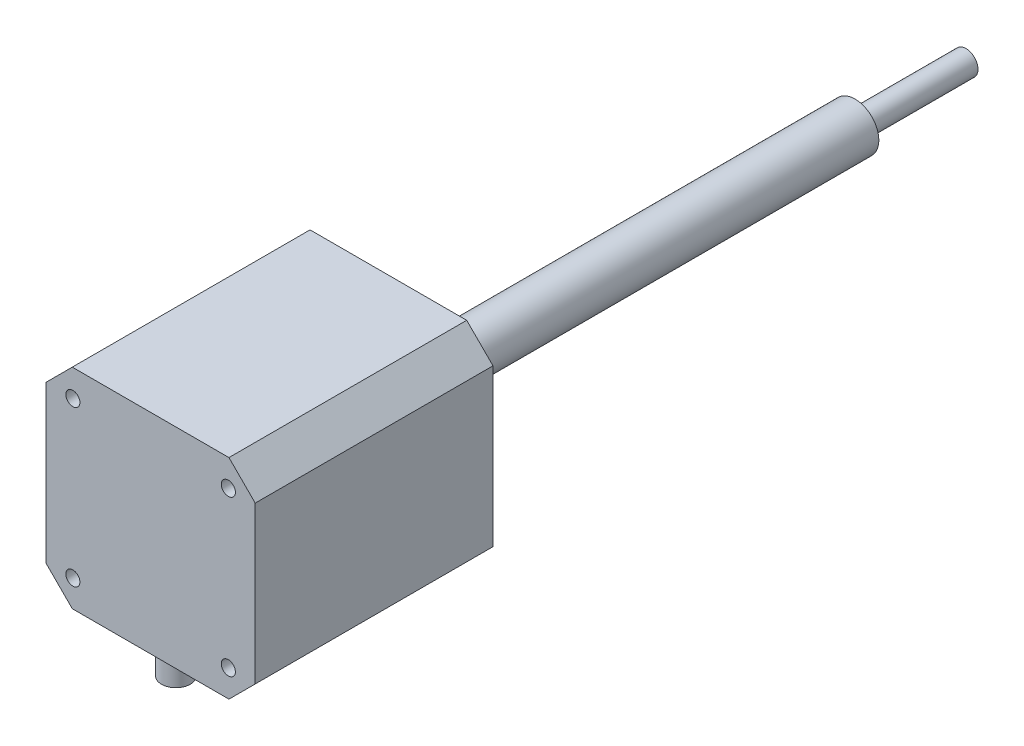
from build123d import *

# Parameters (mm, degrees)
SKETCH1_W           = 41.91
SKETCH1_H           = 41.91
BASE_EXTRUDE_DEPTH  = 47.625
SKETCH2_R           = 1.4097
CUT_EXTRUDE2_DEPTH  = 57.092465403
SKETCH4_R           = 2.8956
BOSS_EXTRUDE2_DEPTH = 6.35


with BuildPart() as part:
    # Sketch1 → Base-Extrude (new body)
    with BuildSketch(Plane.XY):
        Rectangle(SKETCH1_W, SKETCH1_H)
    extrude(amount=BASE_EXTRUDE_DEPTH)

    # Sketch2 → Cut-Extrude2 (cut, through all)
    with BuildSketch(Plane.XY.offset(47.625)):
        with Locations(Location((15.5702, 15.5702, 0), (0, 0, 180))):
            Circle(SKETCH2_R)
        with Locations((15.5702, -15.5702)):
            Circle(SKETCH2_R)
        with Locations((-15.5702, 15.5702)):
            Circle(SKETCH2_R)
        with Locations(Location((-15.5702, -15.5702, 0), (0, 0, 180))):
            Circle(SKETCH2_R)
        Polygon((20.740974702, -15.904485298), (15.940915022, -20.704544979), (13.563579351, -23.08188065), (24.093200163, -23.08188065), (24.093200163, -12.552259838), align=None)
        Polygon((-20.704544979, 15.940915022), (-23.08188065, 13.563579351), (-23.08188065, 24.093200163), (-12.552259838, 24.093200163), (-15.904485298, 20.740974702), align=None)
        Polygon((-23.08188065, -13.563579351), (-23.08188065, -24.093200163), (-12.552259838, -24.093200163), (-15.904485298, -20.740974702), (-20.704544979, -15.940915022), align=None)
        Polygon((13.563579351, 23.08188065), (24.093200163, 23.08188065), (24.093200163, 12.552259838), (20.740974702, 15.904485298), (15.940915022, 20.704544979), align=None)
    extrude(amount=-CUT_EXTRUDE2_DEPTH, mode=Mode.SUBTRACT)

    # Sketch4 → Boss-Extrude2 (add)
    with BuildSketch(Plane(origin=(0, -20.955, 0), x_dir=(-1, 0, 0), z_dir=(0, 1, 0))):
        with Locations((0, 42.55375)):
            Circle(SKETCH4_R)
    extrude(amount=-BOSS_EXTRUDE2_DEPTH)

    # Sketch6 → Boss-Revolve1 (revolve)
    with BuildSketch(Plane(origin=(0, 0, 0), x_dir=(0, 0, -1), z_dir=(1, 0, 0)), mode=Mode.PRIVATE) as boss_revolve1_sk:
        Polygon((0, 3.175), (12.7, 3.175), (12.7, 4.7625), (93.472, 4.7625), (93.472, 2.413), (115.697, 2.413), (115.697, 0), (0, 0), align=None)
    revolve(boss_revolve1_sk.sketch.rotate(Axis((0, 0, 0), (0, 0, 1)), 90), axis=Axis((0, 0, 0), (0, 0, 1)))


solid = part.part
